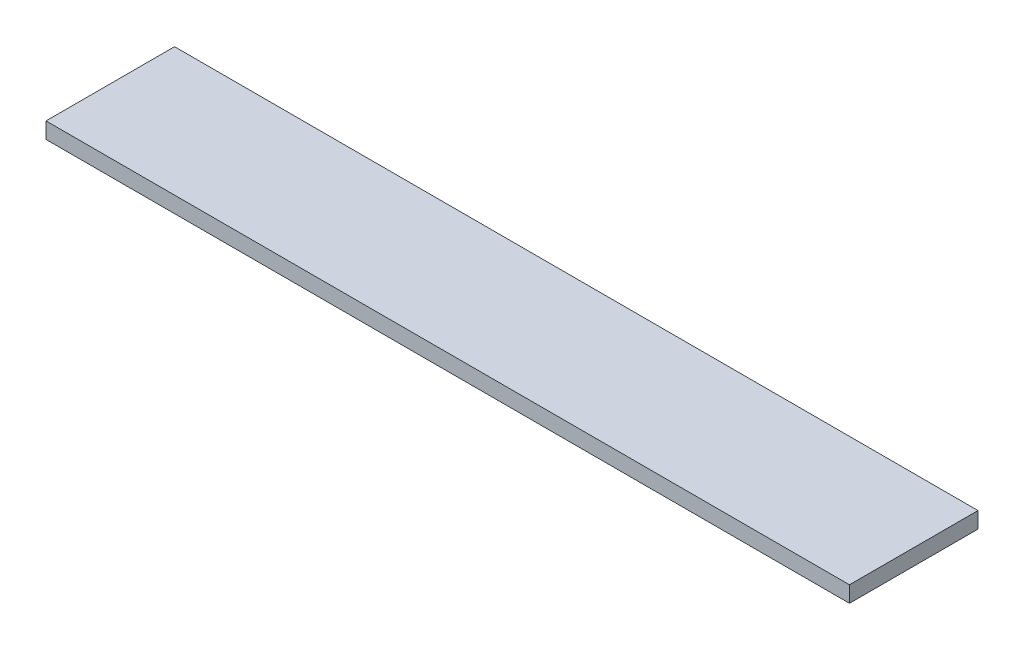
ISO-10303-21;
HEADER;
FILE_DESCRIPTION(('STEP AP214'),'2;1');
FILE_NAME('part.step','',(''),(''),'','','');
FILE_SCHEMA(('AUTOMOTIVE_DESIGN { 1 0 10303 214 1 1 1 1 }'));
ENDSEC;
DATA;
#1=APPLICATION_CONTEXT('core data for automotive mechanical design processes');
#2=APPLICATION_PROTOCOL_DEFINITION('international standard','automotive_design',2000,#1);
#3=PRODUCT_CONTEXT('',#1,'mechanical');
#4=PRODUCT('Part','Part','',(#3));
#5=PRODUCT_RELATED_PRODUCT_CATEGORY('part','',(#4));
#6=PRODUCT_DEFINITION_FORMATION('','',#4);
#7=PRODUCT_DEFINITION_CONTEXT('part definition',#1,'design');
#8=PRODUCT_DEFINITION('design','',#6,#7);
#9=PRODUCT_DEFINITION_SHAPE('','',#8);
#10=(LENGTH_UNIT() NAMED_UNIT(*) SI_UNIT(.MILLI.,.METRE.));
#11=(NAMED_UNIT(*) PLANE_ANGLE_UNIT() SI_UNIT($,.RADIAN.));
#12=(NAMED_UNIT(*) SI_UNIT($,.STERADIAN.) SOLID_ANGLE_UNIT());
#13=UNCERTAINTY_MEASURE_WITH_UNIT(LENGTH_MEASURE(1.E-05),#10,'distance_accuracy_value','');
#14=(GEOMETRIC_REPRESENTATION_CONTEXT(3) GLOBAL_UNCERTAINTY_ASSIGNED_CONTEXT((#13)) GLOBAL_UNIT_ASSIGNED_CONTEXT((#10,
#11,#12)) REPRESENTATION_CONTEXT('',''));
#15=CARTESIAN_POINT('',(0.,0.,0.));
#16=DIRECTION('',(0.,0.,1.));
#17=DIRECTION('',(1.,0.,0.));
#18=AXIS2_PLACEMENT_3D('',#15,#16,#17);
#19=CARTESIAN_POINT('',(-500.,173.639844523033,80.));
#20=DIRECTION('',(1.,0.,0.));
#21=DIRECTION('',(0.,0.,-1.));
#22=AXIS2_PLACEMENT_3D('',#19,#20,#21);
#23=PLANE('',#22);
#24=DIRECTION('',(0.,-1.,0.));
#25=VECTOR('',#24,1.);
#26=CARTESIAN_POINT('',(-500.,173.639844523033,0.));
#27=LINE('',#26,#25);
#28=CARTESIAN_POINT('',(-500.,173.639844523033,0.));
#29=VERTEX_POINT('',#28);
#30=CARTESIAN_POINT('',(-500.,163.639844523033,0.));
#31=VERTEX_POINT('',#30);
#32=EDGE_CURVE('E98',#29,#31,#27,.T.);
#33=ORIENTED_EDGE('',*,*,#32,.T.);
#34=DIRECTION('',(0.,0.,-1.));
#35=VECTOR('',#34,1.);
#36=CARTESIAN_POINT('',(-500.,163.639844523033,80.));
#37=LINE('',#36,#35);
#38=CARTESIAN_POINT('',(-500.,163.639844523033,80.));
#39=VERTEX_POINT('',#38);
#40=EDGE_CURVE('E11',#39,#31,#37,.T.);
#41=ORIENTED_EDGE('',*,*,#40,.F.);
#42=DIRECTION('',(0.,-1.,0.));
#43=VECTOR('',#42,1.);
#44=CARTESIAN_POINT('',(-500.,173.639844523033,80.));
#45=LINE('',#44,#43);
#46=CARTESIAN_POINT('',(-500.,173.639844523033,80.));
#47=VERTEX_POINT('',#46);
#48=EDGE_CURVE('E86',#47,#39,#45,.T.);
#49=ORIENTED_EDGE('',*,*,#48,.F.);
#50=DIRECTION('',(0.,0.,-1.));
#51=VECTOR('',#50,1.);
#52=CARTESIAN_POINT('',(-500.,173.639844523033,80.));
#53=LINE('',#52,#51);
#54=EDGE_CURVE('E94',#47,#29,#53,.T.);
#55=ORIENTED_EDGE('',*,*,#54,.T.);
#56=EDGE_LOOP('',(#33,#41,#49,#55));
#57=FACE_BOUND('',#56,.T.);
#58=ADVANCED_FACE('F35',(#57),#23,.F.);
#59=CARTESIAN_POINT('',(-500.,163.639844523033,80.));
#60=DIRECTION('',(0.,1.,0.));
#61=DIRECTION('',(0.,0.,1.));
#62=AXIS2_PLACEMENT_3D('',#59,#60,#61);
#63=PLANE('',#62);
#64=DIRECTION('',(1.,0.,0.));
#65=VECTOR('',#64,1.);
#66=CARTESIAN_POINT('',(-500.,163.639844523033,0.));
#67=LINE('',#66,#65);
#68=CARTESIAN_POINT('',(0.,163.639844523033,0.));
#69=VERTEX_POINT('',#68);
#70=EDGE_CURVE('E90',#31,#69,#67,.T.);
#71=ORIENTED_EDGE('',*,*,#70,.T.);
#72=DIRECTION('',(0.,0.,-1.));
#73=VECTOR('',#72,1.);
#74=CARTESIAN_POINT('',(0.,163.639844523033,80.));
#75=LINE('',#74,#73);
#76=CARTESIAN_POINT('',(0.,163.639844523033,80.));
#77=VERTEX_POINT('',#76);
#78=EDGE_CURVE('E43',#77,#69,#75,.T.);
#79=ORIENTED_EDGE('',*,*,#78,.F.);
#80=DIRECTION('',(1.,0.,0.));
#81=VECTOR('',#80,1.);
#82=CARTESIAN_POINT('',(-500.,163.639844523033,80.));
#83=LINE('',#82,#81);
#84=EDGE_CURVE('E81',#39,#77,#83,.T.);
#85=ORIENTED_EDGE('',*,*,#84,.F.);
#86=ORIENTED_EDGE('',*,*,#40,.T.);
#87=EDGE_LOOP('',(#71,#79,#85,#86));
#88=FACE_BOUND('',#87,.T.);
#89=ADVANCED_FACE('F89',(#88),#63,.F.);
#90=CARTESIAN_POINT('',(0.,173.639844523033,80.));
#91=DIRECTION('',(-1.,0.,0.));
#92=DIRECTION('',(0.,-1.,0.));
#93=AXIS2_PLACEMENT_3D('',#90,#91,#92);
#94=PLANE('',#93);
#95=DIRECTION('',(0.,1.,0.));
#96=VECTOR('',#95,1.);
#97=CARTESIAN_POINT('',(0.,173.639844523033,0.));
#98=LINE('',#97,#96);
#99=CARTESIAN_POINT('',(0.,173.639844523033,0.));
#100=VERTEX_POINT('',#99);
#101=EDGE_CURVE('E68',#69,#100,#98,.T.);
#102=ORIENTED_EDGE('',*,*,#101,.T.);
#103=DIRECTION('',(0.,0.,-1.));
#104=VECTOR('',#103,1.);
#105=CARTESIAN_POINT('',(0.,173.639844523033,80.));
#106=LINE('',#105,#104);
#107=CARTESIAN_POINT('',(0.,173.639844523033,80.));
#108=VERTEX_POINT('',#107);
#109=EDGE_CURVE('E91',#108,#100,#106,.T.);
#110=ORIENTED_EDGE('',*,*,#109,.F.);
#111=DIRECTION('',(0.,1.,0.));
#112=VECTOR('',#111,1.);
#113=CARTESIAN_POINT('',(0.,173.639844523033,80.));
#114=LINE('',#113,#112);
#115=EDGE_CURVE('E84',#77,#108,#114,.T.);
#116=ORIENTED_EDGE('',*,*,#115,.F.);
#117=ORIENTED_EDGE('',*,*,#78,.T.);
#118=EDGE_LOOP('',(#102,#110,#116,#117));
#119=FACE_BOUND('',#118,.T.);
#120=ADVANCED_FACE('F92',(#119),#94,.F.);
#121=CARTESIAN_POINT('',(-500.,173.639844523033,80.));
#122=DIRECTION('',(0.,-1.,0.));
#123=DIRECTION('',(0.,0.,-1.));
#124=AXIS2_PLACEMENT_3D('',#121,#122,#123);
#125=PLANE('',#124);
#126=DIRECTION('',(-1.,0.,0.));
#127=VECTOR('',#126,1.);
#128=CARTESIAN_POINT('',(-500.,173.639844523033,0.));
#129=LINE('',#128,#127);
#130=EDGE_CURVE('E74',#100,#29,#129,.T.);
#131=ORIENTED_EDGE('',*,*,#130,.T.);
#132=ORIENTED_EDGE('',*,*,#54,.F.);
#133=DIRECTION('',(-1.,0.,0.));
#134=VECTOR('',#133,1.);
#135=CARTESIAN_POINT('',(-500.,173.639844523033,80.));
#136=LINE('',#135,#134);
#137=EDGE_CURVE('E51',#108,#47,#136,.T.);
#138=ORIENTED_EDGE('',*,*,#137,.F.);
#139=ORIENTED_EDGE('',*,*,#109,.T.);
#140=EDGE_LOOP('',(#131,#132,#138,#139));
#141=FACE_BOUND('',#140,.T.);
#142=ADVANCED_FACE('F105',(#141),#125,.F.);
#143=CARTESIAN_POINT('',(0.,0.,80.));
#144=DIRECTION('',(0.,0.,1.));
#145=DIRECTION('',(1.,0.,0.));
#146=AXIS2_PLACEMENT_3D('',#143,#144,#145);
#147=PLANE('',#146);
#148=ORIENTED_EDGE('',*,*,#48,.T.);
#149=ORIENTED_EDGE('',*,*,#84,.T.);
#150=ORIENTED_EDGE('',*,*,#115,.T.);
#151=ORIENTED_EDGE('',*,*,#137,.T.);
#152=EDGE_LOOP('',(#148,#149,#150,#151));
#153=FACE_BOUND('',#152,.T.);
#154=ADVANCED_FACE('F82',(#153),#147,.T.);
#155=CARTESIAN_POINT('',(0.,0.,0.));
#156=DIRECTION('',(0.,0.,1.));
#157=DIRECTION('',(1.,0.,0.));
#158=AXIS2_PLACEMENT_3D('',#155,#156,#157);
#159=PLANE('',#158);
#160=ORIENTED_EDGE('',*,*,#32,.F.);
#161=ORIENTED_EDGE('',*,*,#130,.F.);
#162=ORIENTED_EDGE('',*,*,#101,.F.);
#163=ORIENTED_EDGE('',*,*,#70,.F.);
#164=EDGE_LOOP('',(#160,#161,#162,#163));
#165=FACE_BOUND('',#164,.T.);
#166=ADVANCED_FACE('F108',(#165),#159,.F.);
#167=CLOSED_SHELL('',(#58,#89,#120,#142,#154,#166));
#168=MANIFOLD_SOLID_BREP('B2',#167);
#169=ADVANCED_BREP_SHAPE_REPRESENTATION('',(#18,#168),#14);
#170=SHAPE_DEFINITION_REPRESENTATION(#9,#169);
ENDSEC;
END-ISO-10303-21;
